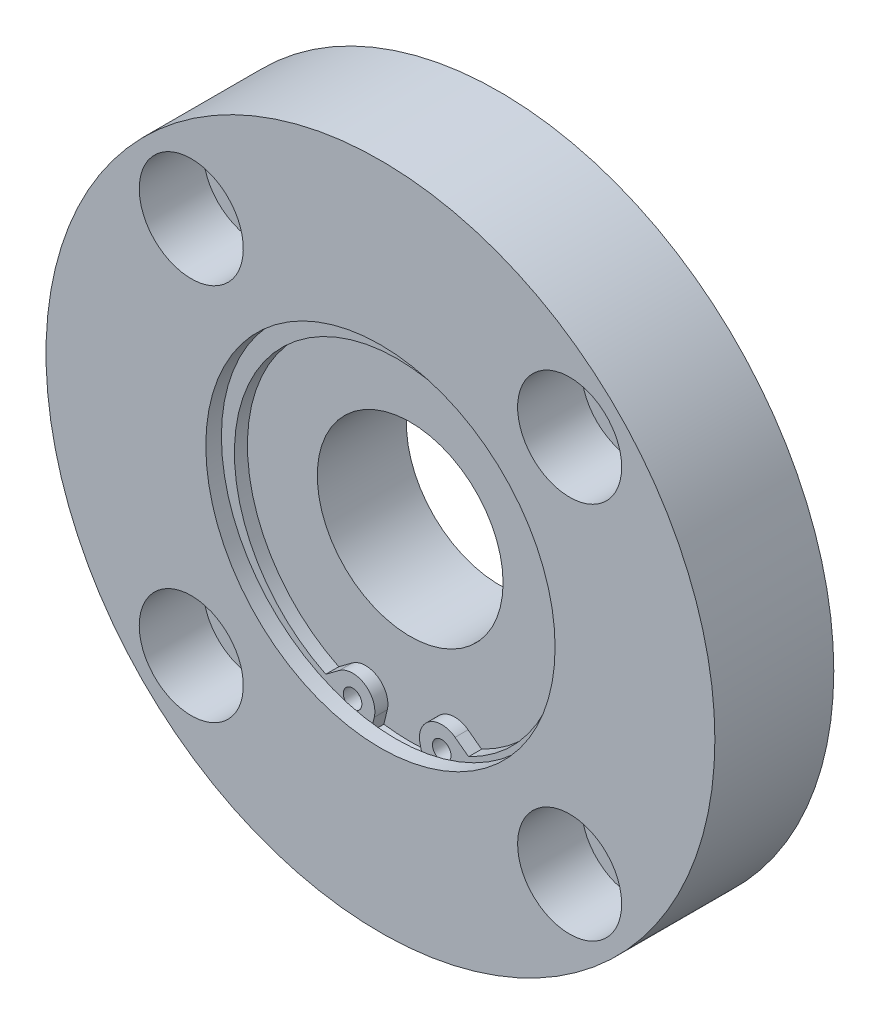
ISO-10303-21;
HEADER;
FILE_DESCRIPTION(('STEP AP214'),'2;1');
FILE_NAME('part.step','',(''),(''),'','','');
FILE_SCHEMA(('AUTOMOTIVE_DESIGN { 1 0 10303 214 1 1 1 1 }'));
ENDSEC;
DATA;
#1=APPLICATION_CONTEXT('core data for automotive mechanical design processes');
#2=APPLICATION_PROTOCOL_DEFINITION('international standard','automotive_design',2000,#1);
#3=PRODUCT_CONTEXT('',#1,'mechanical');
#4=PRODUCT('Part','Part','',(#3));
#5=PRODUCT_RELATED_PRODUCT_CATEGORY('part','',(#4));
#6=PRODUCT_DEFINITION_FORMATION('','',#4);
#7=PRODUCT_DEFINITION_CONTEXT('part definition',#1,'design');
#8=PRODUCT_DEFINITION('design','',#6,#7);
#9=PRODUCT_DEFINITION_SHAPE('','',#8);
#10=(LENGTH_UNIT() NAMED_UNIT(*) SI_UNIT(.MILLI.,.METRE.));
#11=(NAMED_UNIT(*) PLANE_ANGLE_UNIT() SI_UNIT($,.RADIAN.));
#12=(NAMED_UNIT(*) SI_UNIT($,.STERADIAN.) SOLID_ANGLE_UNIT());
#13=UNCERTAINTY_MEASURE_WITH_UNIT(LENGTH_MEASURE(1.E-05),#10,'distance_accuracy_value','');
#14=(GEOMETRIC_REPRESENTATION_CONTEXT(3) GLOBAL_UNCERTAINTY_ASSIGNED_CONTEXT((#13)) GLOBAL_UNIT_ASSIGNED_CONTEXT((#10,
#11,#12)) REPRESENTATION_CONTEXT('',''));
#15=CARTESIAN_POINT('',(0.,0.,0.));
#16=DIRECTION('',(0.,0.,1.));
#17=DIRECTION('',(1.,0.,0.));
#18=AXIS2_PLACEMENT_3D('',#15,#16,#17);
#19=CARTESIAN_POINT('',(25.4558441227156,25.4558441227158,0.));
#20=DIRECTION('',(0.,0.,1.));
#21=DIRECTION('',(1.,0.,0.));
#22=AXIS2_PLACEMENT_3D('',#19,#20,#21);
#23=CYLINDRICAL_SURFACE('',#22,5.);
#24=CARTESIAN_POINT('',(25.4558441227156,25.4558441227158,0.));
#25=DIRECTION('',(0.,0.,1.));
#26=DIRECTION('',(1.,0.,0.));
#27=AXIS2_PLACEMENT_3D('',#24,#25,#26);
#28=CIRCLE('',#27,5.);
#29=CARTESIAN_POINT('',(30.4558441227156,25.4558441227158,0.));
#30=VERTEX_POINT('',#29);
#31=EDGE_CURVE('E225',#30,#30,#28,.T.);
#32=ORIENTED_EDGE('',*,*,#31,.F.);
#33=EDGE_LOOP('',(#32));
#34=FACE_BOUND('',#33,.T.);
#35=CARTESIAN_POINT('',(25.4558441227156,25.4558441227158,7.4));
#36=DIRECTION('',(0.,0.,1.));
#37=DIRECTION('',(1.,0.,0.));
#38=AXIS2_PLACEMENT_3D('',#35,#36,#37);
#39=CIRCLE('',#38,5.);
#40=CARTESIAN_POINT('',(30.4558441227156,25.4558441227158,7.4));
#41=VERTEX_POINT('',#40);
#42=EDGE_CURVE('E224',#41,#41,#39,.F.);
#43=ORIENTED_EDGE('',*,*,#42,.F.);
#44=EDGE_LOOP('',(#43));
#45=FACE_BOUND('',#44,.T.);
#46=ADVANCED_FACE('F14',(#34,#45),#23,.F.);
#47=CARTESIAN_POINT('',(25.4558441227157,-25.4558441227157,0.));
#48=DIRECTION('',(0.,0.,1.));
#49=DIRECTION('',(1.,0.,0.));
#50=AXIS2_PLACEMENT_3D('',#47,#48,#49);
#51=CYLINDRICAL_SURFACE('',#50,5.);
#52=CARTESIAN_POINT('',(25.4558441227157,-25.4558441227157,0.));
#53=DIRECTION('',(0.,0.,1.));
#54=DIRECTION('',(0.,-1.,0.));
#55=AXIS2_PLACEMENT_3D('',#52,#53,#54);
#56=CIRCLE('',#55,5.);
#57=CARTESIAN_POINT('',(25.4558441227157,-30.4558441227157,0.));
#58=VERTEX_POINT('',#57);
#59=EDGE_CURVE('E215',#58,#58,#56,.T.);
#60=ORIENTED_EDGE('',*,*,#59,.F.);
#61=EDGE_LOOP('',(#60));
#62=FACE_BOUND('',#61,.T.);
#63=CARTESIAN_POINT('',(25.4558441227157,-25.4558441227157,7.4));
#64=DIRECTION('',(0.,0.,1.));
#65=DIRECTION('',(1.,0.,0.));
#66=AXIS2_PLACEMENT_3D('',#63,#64,#65);
#67=CIRCLE('',#66,5.);
#68=CARTESIAN_POINT('',(30.4558441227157,-25.4558441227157,7.4));
#69=VERTEX_POINT('',#68);
#70=EDGE_CURVE('E208',#69,#69,#67,.F.);
#71=ORIENTED_EDGE('',*,*,#70,.F.);
#72=EDGE_LOOP('',(#71));
#73=FACE_BOUND('',#72,.T.);
#74=ADVANCED_FACE('F339',(#62,#73),#51,.F.);
#75=CARTESIAN_POINT('',(-25.4558441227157,-25.4558441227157,0.));
#76=DIRECTION('',(0.,0.,1.));
#77=DIRECTION('',(1.,0.,0.));
#78=AXIS2_PLACEMENT_3D('',#75,#76,#77);
#79=CYLINDRICAL_SURFACE('',#78,5.);
#80=CARTESIAN_POINT('',(-25.4558441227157,-25.4558441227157,0.));
#81=DIRECTION('',(0.,0.,1.));
#82=DIRECTION('',(-1.,0.,0.));
#83=AXIS2_PLACEMENT_3D('',#80,#81,#82);
#84=CIRCLE('',#83,5.);
#85=CARTESIAN_POINT('',(-30.4558441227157,-25.4558441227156,0.));
#86=VERTEX_POINT('',#85);
#87=EDGE_CURVE('E212',#86,#86,#84,.T.);
#88=ORIENTED_EDGE('',*,*,#87,.F.);
#89=EDGE_LOOP('',(#88));
#90=FACE_BOUND('',#89,.T.);
#91=CARTESIAN_POINT('',(-25.4558441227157,-25.4558441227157,7.4));
#92=DIRECTION('',(0.,0.,1.));
#93=DIRECTION('',(1.,0.,0.));
#94=AXIS2_PLACEMENT_3D('',#91,#92,#93);
#95=CIRCLE('',#94,5.);
#96=CARTESIAN_POINT('',(-20.4558441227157,-25.4558441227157,7.4));
#97=VERTEX_POINT('',#96);
#98=EDGE_CURVE('E201',#97,#97,#95,.F.);
#99=ORIENTED_EDGE('',*,*,#98,.F.);
#100=EDGE_LOOP('',(#99));
#101=FACE_BOUND('',#100,.T.);
#102=ADVANCED_FACE('F352',(#90,#101),#79,.F.);
#103=CARTESIAN_POINT('',(-25.4558441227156,25.4558441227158,0.));
#104=DIRECTION('',(0.,0.,1.));
#105=DIRECTION('',(1.,0.,0.));
#106=AXIS2_PLACEMENT_3D('',#103,#104,#105);
#107=CYLINDRICAL_SURFACE('',#106,5.);
#108=CARTESIAN_POINT('',(-25.4558441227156,25.4558441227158,0.));
#109=DIRECTION('',(0.,0.,1.));
#110=DIRECTION('',(0.,1.,0.));
#111=AXIS2_PLACEMENT_3D('',#108,#109,#110);
#112=CIRCLE('',#111,5.);
#113=CARTESIAN_POINT('',(-25.4558441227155,30.4558441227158,0.));
#114=VERTEX_POINT('',#113);
#115=EDGE_CURVE('E209',#114,#114,#112,.T.);
#116=ORIENTED_EDGE('',*,*,#115,.F.);
#117=EDGE_LOOP('',(#116));
#118=FACE_BOUND('',#117,.T.);
#119=CARTESIAN_POINT('',(-25.4558441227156,25.4558441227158,7.4));
#120=DIRECTION('',(0.,0.,1.));
#121=DIRECTION('',(1.,0.,0.));
#122=AXIS2_PLACEMENT_3D('',#119,#120,#121);
#123=CIRCLE('',#122,5.);
#124=CARTESIAN_POINT('',(-20.4558441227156,25.4558441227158,7.4));
#125=VERTEX_POINT('',#124);
#126=EDGE_CURVE('E194',#125,#125,#123,.F.);
#127=ORIENTED_EDGE('',*,*,#126,.F.);
#128=EDGE_LOOP('',(#127));
#129=FACE_BOUND('',#128,.T.);
#130=ADVANCED_FACE('F356',(#118,#129),#107,.F.);
#131=CARTESIAN_POINT('',(0.,0.,-5.));
#132=DIRECTION('',(0.,0.,1.));
#133=DIRECTION('',(1.,0.,0.));
#134=AXIS2_PLACEMENT_3D('',#131,#132,#133);
#135=CYLINDRICAL_SURFACE('',#134,27.);
#136=CARTESIAN_POINT('',(0.,0.,-5.));
#137=DIRECTION('',(0.,0.,-1.));
#138=DIRECTION('',(-1.,0.,0.));
#139=AXIS2_PLACEMENT_3D('',#136,#137,#138);
#140=CIRCLE('',#139,27.);
#141=CARTESIAN_POINT('',(-27.,0.,-5.));
#142=VERTEX_POINT('',#141);
#143=EDGE_CURVE('E176',#142,#142,#140,.T.);
#144=ORIENTED_EDGE('',*,*,#143,.F.);
#145=EDGE_LOOP('',(#144));
#146=FACE_BOUND('',#145,.T.);
#147=CARTESIAN_POINT('',(0.,0.,0.));
#148=DIRECTION('',(0.,0.,-1.));
#149=DIRECTION('',(-1.,0.,0.));
#150=AXIS2_PLACEMENT_3D('',#147,#148,#149);
#151=CIRCLE('',#150,27.);
#152=CARTESIAN_POINT('',(-27.,0.,0.));
#153=VERTEX_POINT('',#152);
#154=EDGE_CURVE('E177',#153,#153,#151,.T.);
#155=ORIENTED_EDGE('',*,*,#154,.T.);
#156=EDGE_LOOP('',(#155));
#157=FACE_BOUND('',#156,.T.);
#158=ADVANCED_FACE('F360',(#146,#157),#135,.T.);
#159=CARTESIAN_POINT('',(0.,0.,0.));
#160=DIRECTION('',(0.,0.,1.));
#161=DIRECTION('',(1.,0.,0.));
#162=AXIS2_PLACEMENT_3D('',#159,#160,#161);
#163=PLANE('',#162);
#164=ORIENTED_EDGE('',*,*,#115,.T.);
#165=EDGE_LOOP('',(#164));
#166=FACE_BOUND('',#165,.T.);
#167=ORIENTED_EDGE('',*,*,#87,.T.);
#168=EDGE_LOOP('',(#167));
#169=FACE_BOUND('',#168,.T.);
#170=ORIENTED_EDGE('',*,*,#59,.T.);
#171=EDGE_LOOP('',(#170));
#172=FACE_BOUND('',#171,.T.);
#173=ORIENTED_EDGE('',*,*,#31,.T.);
#174=EDGE_LOOP('',(#173));
#175=FACE_BOUND('',#174,.T.);
#176=CARTESIAN_POINT('',(0.,0.,0.));
#177=DIRECTION('',(0.,0.,1.));
#178=DIRECTION('',(1.,0.,0.));
#179=AXIS2_PLACEMENT_3D('',#176,#177,#178);
#180=CIRCLE('',#179,45.);
#181=CARTESIAN_POINT('',(45.,0.,0.));
#182=VERTEX_POINT('',#181);
#183=EDGE_CURVE('E231',#182,#182,#180,.T.);
#184=ORIENTED_EDGE('',*,*,#183,.F.);
#185=EDGE_LOOP('',(#184));
#186=FACE_BOUND('',#185,.T.);
#187=ORIENTED_EDGE('',*,*,#154,.F.);
#188=EDGE_LOOP('',(#187));
#189=FACE_BOUND('',#188,.T.);
#190=ADVANCED_FACE('F332',(#166,#169,#172,#175,#186,#189),#163,.F.);
#191=CARTESIAN_POINT('',(25.4558441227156,25.4558441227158,7.4));
#192=DIRECTION('',(0.,0.,1.));
#193=DIRECTION('',(1.,0.,0.));
#194=AXIS2_PLACEMENT_3D('',#191,#192,#193);
#195=PLANE('',#194);
#196=CARTESIAN_POINT('',(25.4558441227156,25.4558441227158,7.4));
#197=DIRECTION('',(0.,0.,1.));
#198=DIRECTION('',(1.,0.,0.));
#199=AXIS2_PLACEMENT_3D('',#196,#197,#198);
#200=CIRCLE('',#199,7.);
#201=CARTESIAN_POINT('',(32.4558441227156,25.4558441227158,7.4));
#202=VERTEX_POINT('',#201);
#203=EDGE_CURVE('E221',#202,#202,#200,.T.);
#204=ORIENTED_EDGE('',*,*,#203,.T.);
#205=EDGE_LOOP('',(#204));
#206=FACE_BOUND('',#205,.T.);
#207=ORIENTED_EDGE('',*,*,#42,.T.);
#208=EDGE_LOOP('',(#207));
#209=FACE_BOUND('',#208,.T.);
#210=ADVANCED_FACE('F345',(#206,#209),#195,.T.);
#211=CARTESIAN_POINT('',(25.4558441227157,-25.4558441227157,7.4));
#212=DIRECTION('',(0.,0.,1.));
#213=DIRECTION('',(0.,-1.,0.));
#214=AXIS2_PLACEMENT_3D('',#211,#212,#213);
#215=PLANE('',#214);
#216=CARTESIAN_POINT('',(25.4558441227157,-25.4558441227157,7.4));
#217=DIRECTION('',(0.,0.,1.));
#218=DIRECTION('',(0.,-1.,0.));
#219=AXIS2_PLACEMENT_3D('',#216,#217,#218);
#220=CIRCLE('',#219,7.);
#221=CARTESIAN_POINT('',(25.4558441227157,-32.4558441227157,7.4));
#222=VERTEX_POINT('',#221);
#223=EDGE_CURVE('E205',#222,#222,#220,.T.);
#224=ORIENTED_EDGE('',*,*,#223,.T.);
#225=EDGE_LOOP('',(#224));
#226=FACE_BOUND('',#225,.T.);
#227=ORIENTED_EDGE('',*,*,#70,.T.);
#228=EDGE_LOOP('',(#227));
#229=FACE_BOUND('',#228,.T.);
#230=ADVANCED_FACE('F348',(#226,#229),#215,.T.);
#231=CARTESIAN_POINT('',(-25.4558441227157,-25.4558441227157,7.4));
#232=DIRECTION('',(0.,0.,1.));
#233=DIRECTION('',(-1.,0.,0.));
#234=AXIS2_PLACEMENT_3D('',#231,#232,#233);
#235=PLANE('',#234);
#236=CARTESIAN_POINT('',(-25.4558441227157,-25.4558441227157,7.4));
#237=DIRECTION('',(0.,0.,1.));
#238=DIRECTION('',(-1.,0.,0.));
#239=AXIS2_PLACEMENT_3D('',#236,#237,#238);
#240=CIRCLE('',#239,7.);
#241=CARTESIAN_POINT('',(-32.4558441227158,-25.4558441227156,7.4));
#242=VERTEX_POINT('',#241);
#243=EDGE_CURVE('E198',#242,#242,#240,.T.);
#244=ORIENTED_EDGE('',*,*,#243,.T.);
#245=EDGE_LOOP('',(#244));
#246=FACE_BOUND('',#245,.T.);
#247=ORIENTED_EDGE('',*,*,#98,.T.);
#248=EDGE_LOOP('',(#247));
#249=FACE_BOUND('',#248,.T.);
#250=ADVANCED_FACE('F368',(#246,#249),#235,.T.);
#251=CARTESIAN_POINT('',(-25.4558441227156,25.4558441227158,7.4));
#252=DIRECTION('',(0.,0.,1.));
#253=DIRECTION('',(0.,1.,0.));
#254=AXIS2_PLACEMENT_3D('',#251,#252,#253);
#255=PLANE('',#254);
#256=CARTESIAN_POINT('',(-25.4558441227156,25.4558441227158,7.4));
#257=DIRECTION('',(0.,0.,1.));
#258=DIRECTION('',(0.,1.,0.));
#259=AXIS2_PLACEMENT_3D('',#256,#257,#258);
#260=CIRCLE('',#259,7.);
#261=CARTESIAN_POINT('',(-25.4558441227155,32.4558441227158,7.4));
#262=VERTEX_POINT('',#261);
#263=EDGE_CURVE('E191',#262,#262,#260,.T.);
#264=ORIENTED_EDGE('',*,*,#263,.T.);
#265=EDGE_LOOP('',(#264));
#266=FACE_BOUND('',#265,.T.);
#267=ORIENTED_EDGE('',*,*,#126,.T.);
#268=EDGE_LOOP('',(#267));
#269=FACE_BOUND('',#268,.T.);
#270=ADVANCED_FACE('F376',(#266,#269),#255,.T.);
#271=CARTESIAN_POINT('',(0.,0.,-5.));
#272=DIRECTION('',(0.,0.,-1.));
#273=DIRECTION('',(-1.,0.,0.));
#274=AXIS2_PLACEMENT_3D('',#271,#272,#273);
#275=PLANE('',#274);
#276=ORIENTED_EDGE('',*,*,#143,.T.);
#277=EDGE_LOOP('',(#276));
#278=FACE_BOUND('',#277,.T.);
#279=CARTESIAN_POINT('',(0.,0.,-5.));
#280=DIRECTION('',(0.,0.,-1.));
#281=DIRECTION('',(-1.,0.,0.));
#282=AXIS2_PLACEMENT_3D('',#279,#280,#281);
#283=CIRCLE('',#282,20.5);
#284=CARTESIAN_POINT('',(-20.5,0.,-5.));
#285=VERTEX_POINT('',#284);
#286=EDGE_CURVE('E173',#285,#285,#283,.T.);
#287=ORIENTED_EDGE('',*,*,#286,.F.);
#288=EDGE_LOOP('',(#287));
#289=FACE_BOUND('',#288,.T.);
#290=ADVANCED_FACE('F320',(#278,#289),#275,.T.);
#291=CARTESIAN_POINT('',(0.,0.,16.));
#292=DIRECTION('',(0.,0.,-1.));
#293=DIRECTION('',(-1.,0.,0.));
#294=AXIS2_PLACEMENT_3D('',#291,#292,#293);
#295=CYLINDRICAL_SURFACE('',#294,45.);
#296=CARTESIAN_POINT('',(0.,0.,16.));
#297=DIRECTION('',(0.,0.,1.));
#298=DIRECTION('',(1.,0.,0.));
#299=AXIS2_PLACEMENT_3D('',#296,#297,#298);
#300=CIRCLE('',#299,45.);
#301=CARTESIAN_POINT('',(45.,0.,16.));
#302=VERTEX_POINT('',#301);
#303=EDGE_CURVE('E181',#302,#302,#300,.T.);
#304=ORIENTED_EDGE('',*,*,#303,.F.);
#305=EDGE_LOOP('',(#304));
#306=FACE_BOUND('',#305,.T.);
#307=ORIENTED_EDGE('',*,*,#183,.T.);
#308=EDGE_LOOP('',(#307));
#309=FACE_BOUND('',#308,.T.);
#310=ADVANCED_FACE('F316',(#306,#309),#295,.T.);
#311=CARTESIAN_POINT('',(25.4558441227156,25.4558441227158,7.4));
#312=DIRECTION('',(0.,0.,1.));
#313=DIRECTION('',(1.,0.,0.));
#314=AXIS2_PLACEMENT_3D('',#311,#312,#313);
#315=CYLINDRICAL_SURFACE('',#314,7.);
#316=ORIENTED_EDGE('',*,*,#203,.F.);
#317=EDGE_LOOP('',(#316));
#318=FACE_BOUND('',#317,.T.);
#319=CARTESIAN_POINT('',(25.4558441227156,25.4558441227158,16.));
#320=DIRECTION('',(0.,0.,1.));
#321=DIRECTION('',(1.,0.,0.));
#322=AXIS2_PLACEMENT_3D('',#319,#320,#321);
#323=CIRCLE('',#322,7.);
#324=CARTESIAN_POINT('',(32.4558441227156,25.4558441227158,16.));
#325=VERTEX_POINT('',#324);
#326=EDGE_CURVE('E218',#325,#325,#323,.T.);
#327=ORIENTED_EDGE('',*,*,#326,.T.);
#328=EDGE_LOOP('',(#327));
#329=FACE_BOUND('',#328,.T.);
#330=ADVANCED_FACE('F319',(#318,#329),#315,.F.);
#331=CARTESIAN_POINT('',(25.4558441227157,-25.4558441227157,7.4));
#332=DIRECTION('',(0.,0.,1.));
#333=DIRECTION('',(1.,0.,0.));
#334=AXIS2_PLACEMENT_3D('',#331,#332,#333);
#335=CYLINDRICAL_SURFACE('',#334,7.);
#336=ORIENTED_EDGE('',*,*,#223,.F.);
#337=EDGE_LOOP('',(#336));
#338=FACE_BOUND('',#337,.T.);
#339=CARTESIAN_POINT('',(25.4558441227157,-25.4558441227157,16.));
#340=DIRECTION('',(0.,0.,1.));
#341=DIRECTION('',(0.,-1.,0.));
#342=AXIS2_PLACEMENT_3D('',#339,#340,#341);
#343=CIRCLE('',#342,7.);
#344=CARTESIAN_POINT('',(25.4558441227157,-32.4558441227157,16.));
#345=VERTEX_POINT('',#344);
#346=EDGE_CURVE('E202',#345,#345,#343,.T.);
#347=ORIENTED_EDGE('',*,*,#346,.T.);
#348=EDGE_LOOP('',(#347));
#349=FACE_BOUND('',#348,.T.);
#350=ADVANCED_FACE('F343',(#338,#349),#335,.F.);
#351=CARTESIAN_POINT('',(-25.4558441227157,-25.4558441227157,7.4));
#352=DIRECTION('',(0.,0.,1.));
#353=DIRECTION('',(1.,0.,0.));
#354=AXIS2_PLACEMENT_3D('',#351,#352,#353);
#355=CYLINDRICAL_SURFACE('',#354,7.);
#356=ORIENTED_EDGE('',*,*,#243,.F.);
#357=EDGE_LOOP('',(#356));
#358=FACE_BOUND('',#357,.T.);
#359=CARTESIAN_POINT('',(-25.4558441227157,-25.4558441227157,16.));
#360=DIRECTION('',(0.,0.,1.));
#361=DIRECTION('',(-1.,0.,0.));
#362=AXIS2_PLACEMENT_3D('',#359,#360,#361);
#363=CIRCLE('',#362,7.);
#364=CARTESIAN_POINT('',(-32.4558441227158,-25.4558441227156,16.));
#365=VERTEX_POINT('',#364);
#366=EDGE_CURVE('E195',#365,#365,#363,.T.);
#367=ORIENTED_EDGE('',*,*,#366,.T.);
#368=EDGE_LOOP('',(#367));
#369=FACE_BOUND('',#368,.T.);
#370=ADVANCED_FACE('F364',(#358,#369),#355,.F.);
#371=CARTESIAN_POINT('',(-25.4558441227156,25.4558441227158,7.4));
#372=DIRECTION('',(0.,0.,1.));
#373=DIRECTION('',(1.,0.,0.));
#374=AXIS2_PLACEMENT_3D('',#371,#372,#373);
#375=CYLINDRICAL_SURFACE('',#374,7.);
#376=ORIENTED_EDGE('',*,*,#263,.F.);
#377=EDGE_LOOP('',(#376));
#378=FACE_BOUND('',#377,.T.);
#379=CARTESIAN_POINT('',(-25.4558441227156,25.4558441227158,16.));
#380=DIRECTION('',(0.,0.,1.));
#381=DIRECTION('',(0.,1.,0.));
#382=AXIS2_PLACEMENT_3D('',#379,#380,#381);
#383=CIRCLE('',#382,7.);
#384=CARTESIAN_POINT('',(-25.4558441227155,32.4558441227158,16.));
#385=VERTEX_POINT('',#384);
#386=EDGE_CURVE('E188',#385,#385,#383,.T.);
#387=ORIENTED_EDGE('',*,*,#386,.T.);
#388=EDGE_LOOP('',(#387));
#389=FACE_BOUND('',#388,.T.);
#390=ADVANCED_FACE('F372',(#378,#389),#375,.F.);
#391=CARTESIAN_POINT('',(0.,0.,-5.));
#392=DIRECTION('',(0.,0.,1.));
#393=DIRECTION('',(1.,0.,0.));
#394=AXIS2_PLACEMENT_3D('',#391,#392,#393);
#395=CYLINDRICAL_SURFACE('',#394,20.5);
#396=ORIENTED_EDGE('',*,*,#286,.T.);
#397=EDGE_LOOP('',(#396));
#398=FACE_BOUND('',#397,.T.);
#399=CARTESIAN_POINT('',(0.,0.,0.));
#400=DIRECTION('',(0.,0.,-1.));
#401=DIRECTION('',(-1.,0.,0.));
#402=AXIS2_PLACEMENT_3D('',#399,#400,#401);
#403=CIRCLE('',#402,20.5);
#404=CARTESIAN_POINT('',(-20.5,0.,0.));
#405=VERTEX_POINT('',#404);
#406=EDGE_CURVE('E170',#405,#405,#403,.T.);
#407=ORIENTED_EDGE('',*,*,#406,.F.);
#408=EDGE_LOOP('',(#407));
#409=FACE_BOUND('',#408,.T.);
#410=ADVANCED_FACE('F326',(#398,#409),#395,.F.);
#411=CARTESIAN_POINT('',(0.,0.,16.));
#412=DIRECTION('',(0.,0.,1.));
#413=DIRECTION('',(1.,0.,0.));
#414=AXIS2_PLACEMENT_3D('',#411,#412,#413);
#415=PLANE('',#414);
#416=CARTESIAN_POINT('',(0.,0.,16.));
#417=DIRECTION('',(0.,0.,1.));
#418=DIRECTION('',(1.,0.,0.));
#419=AXIS2_PLACEMENT_3D('',#416,#417,#418);
#420=CIRCLE('',#419,23.5);
#421=CARTESIAN_POINT('',(23.5,0.,16.));
#422=VERTEX_POINT('',#421);
#423=EDGE_CURVE('E184',#422,#422,#420,.T.);
#424=ORIENTED_EDGE('',*,*,#423,.F.);
#425=EDGE_LOOP('',(#424));
#426=FACE_BOUND('',#425,.T.);
#427=ORIENTED_EDGE('',*,*,#386,.F.);
#428=EDGE_LOOP('',(#427));
#429=FACE_BOUND('',#428,.T.);
#430=ORIENTED_EDGE('',*,*,#366,.F.);
#431=EDGE_LOOP('',(#430));
#432=FACE_BOUND('',#431,.T.);
#433=ORIENTED_EDGE('',*,*,#346,.F.);
#434=EDGE_LOOP('',(#433));
#435=FACE_BOUND('',#434,.T.);
#436=ORIENTED_EDGE('',*,*,#326,.F.);
#437=EDGE_LOOP('',(#436));
#438=FACE_BOUND('',#437,.T.);
#439=ORIENTED_EDGE('',*,*,#303,.T.);
#440=EDGE_LOOP('',(#439));
#441=FACE_BOUND('',#440,.T.);
#442=ADVANCED_FACE('F322',(#426,#429,#432,#435,#438,#441),#415,.T.);
#443=ORIENTED_EDGE('',*,*,#406,.T.);
#444=EDGE_LOOP('',(#443));
#445=FACE_BOUND('',#444,.T.);
#446=CARTESIAN_POINT('',(0.,0.,0.));
#447=DIRECTION('',(0.,0.,1.));
#448=DIRECTION('',(1.,0.,0.));
#449=AXIS2_PLACEMENT_3D('',#446,#447,#448);
#450=CIRCLE('',#449,12.5);
#451=CARTESIAN_POINT('',(12.5,0.,0.));
#452=VERTEX_POINT('',#451);
#453=EDGE_CURVE('E228',#452,#452,#450,.T.);
#454=ORIENTED_EDGE('',*,*,#453,.T.);
#455=EDGE_LOOP('',(#454));
#456=FACE_BOUND('',#455,.T.);
#457=ADVANCED_FACE('F325',(#445,#456),#163,.F.);
#458=CARTESIAN_POINT('',(0.,0.,12.));
#459=DIRECTION('',(0.,0.,1.));
#460=DIRECTION('',(1.,0.,0.));
#461=AXIS2_PLACEMENT_3D('',#458,#459,#460);
#462=CYLINDRICAL_SURFACE('',#461,23.5);
#463=CARTESIAN_POINT('',(0.,0.,13.9));
#464=DIRECTION('',(0.,0.,1.));
#465=DIRECTION('',(1.,0.,0.));
#466=AXIS2_PLACEMENT_3D('',#463,#464,#465);
#467=CIRCLE('',#466,23.5);
#468=CARTESIAN_POINT('',(23.5,0.,13.9));
#469=VERTEX_POINT('',#468);
#470=EDGE_CURVE('E167',#469,#469,#467,.F.);
#471=ORIENTED_EDGE('',*,*,#470,.T.);
#472=EDGE_LOOP('',(#471));
#473=FACE_BOUND('',#472,.T.);
#474=ORIENTED_EDGE('',*,*,#423,.T.);
#475=EDGE_LOOP('',(#474));
#476=FACE_BOUND('',#475,.T.);
#477=ADVANCED_FACE('F330',(#473,#476),#462,.F.);
#478=CARTESIAN_POINT('',(0.,0.,16.));
#479=DIRECTION('',(0.,0.,-1.));
#480=DIRECTION('',(-1.,0.,0.));
#481=AXIS2_PLACEMENT_3D('',#478,#479,#480);
#482=CYLINDRICAL_SURFACE('',#481,12.5);
#483=ORIENTED_EDGE('',*,*,#453,.F.);
#484=EDGE_LOOP('',(#483));
#485=FACE_BOUND('',#484,.T.);
#486=CARTESIAN_POINT('',(0.,0.,12.));
#487=DIRECTION('',(0.,0.,1.));
#488=DIRECTION('',(1.,0.,0.));
#489=AXIS2_PLACEMENT_3D('',#486,#487,#488);
#490=CIRCLE('',#489,12.5);
#491=CARTESIAN_POINT('',(12.5,0.,12.));
#492=VERTEX_POINT('',#491);
#493=EDGE_CURVE('E187',#492,#492,#490,.T.);
#494=ORIENTED_EDGE('',*,*,#493,.T.);
#495=EDGE_LOOP('',(#494));
#496=FACE_BOUND('',#495,.T.);
#497=ADVANCED_FACE('F333',(#485,#496),#482,.F.);
#498=CARTESIAN_POINT('',(0.,0.,12.));
#499=DIRECTION('',(0.,0.,1.));
#500=DIRECTION('',(1.,0.,0.));
#501=AXIS2_PLACEMENT_3D('',#498,#499,#500);
#502=PLANE('',#501);
#503=ORIENTED_EDGE('',*,*,#493,.F.);
#504=EDGE_LOOP('',(#503));
#505=FACE_BOUND('',#504,.T.);
#506=CARTESIAN_POINT('',(0.,0.,12.));
#507=DIRECTION('',(0.,0.,1.));
#508=DIRECTION('',(1.,0.,0.));
#509=AXIS2_PLACEMENT_3D('',#506,#507,#508);
#510=CIRCLE('',#509,24.75);
#511=CARTESIAN_POINT('',(-3.53738888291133,-24.4959053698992,12.));
#512=VERTEX_POINT('',#511);
#513=CARTESIAN_POINT('',(3.53738888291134,-24.4959053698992,12.));
#514=VERTEX_POINT('',#513);
#515=EDGE_CURVE('E157',#512,#514,#510,.T.);
#516=ORIENTED_EDGE('',*,*,#515,.T.);
#517=DIRECTION('',(-0.231349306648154,0.972870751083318,0.));
#518=VECTOR('',#517,1.);
#519=CARTESIAN_POINT('',(-2.16530728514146,-0.514911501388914,12.));
#520=LINE('',#519,#518);
#521=CARTESIAN_POINT('',(3.08138774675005,-22.5783281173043,12.));
#522=VERTEX_POINT('',#521);
#523=EDGE_CURVE('E9',#514,#522,#520,.T.);
#524=ORIENTED_EDGE('',*,*,#523,.T.);
#525=CARTESIAN_POINT('',(6.,-21.8842801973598,12.));
#526=DIRECTION('',(0.,0.,1.));
#527=DIRECTION('',(1.,0.,0.));
#528=AXIS2_PLACEMENT_3D('',#525,#526,#527);
#529=CIRCLE('',#528,3.);
#530=CARTESIAN_POINT('',(7.7896612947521,-19.4765608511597,12.));
#531=VERTEX_POINT('',#530);
#532=EDGE_CURVE('E25',#531,#522,#529,.T.);
#533=ORIENTED_EDGE('',*,*,#532,.F.);
#534=DIRECTION('',(0.802573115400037,-0.596553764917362,0.));
#535=VECTOR('',#534,1.);
#536=CARTESIAN_POINT('',(-6.55279254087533,-8.81579403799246,12.));
#537=LINE('',#536,#535);
#538=CARTESIAN_POINT('',(9.60938951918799,-20.8291674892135,12.));
#539=VERTEX_POINT('',#538);
#540=EDGE_CURVE('E101',#531,#539,#537,.T.);
#541=ORIENTED_EDGE('',*,*,#540,.T.);
#542=CARTESIAN_POINT('',(0.,-1.15,12.));
#543=DIRECTION('',(0.,0.,1.));
#544=DIRECTION('',(1.,0.,0.));
#545=AXIS2_PLACEMENT_3D('',#542,#543,#544);
#546=CIRCLE('',#545,21.9);
#547=CARTESIAN_POINT('',(-9.60938951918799,-20.8291674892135,12.));
#548=VERTEX_POINT('',#547);
#549=EDGE_CURVE('E104',#539,#548,#546,.T.);
#550=ORIENTED_EDGE('',*,*,#549,.T.);
#551=DIRECTION('',(0.802573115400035,0.596553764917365,0.));
#552=VECTOR('',#551,1.);
#553=CARTESIAN_POINT('',(6.55279254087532,-8.81579403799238,12.));
#554=LINE('',#553,#552);
#555=CARTESIAN_POINT('',(-7.7896612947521,-19.4765608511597,12.));
#556=VERTEX_POINT('',#555);
#557=EDGE_CURVE('E119',#548,#556,#554,.T.);
#558=ORIENTED_EDGE('',*,*,#557,.T.);
#559=CARTESIAN_POINT('',(-6.,-21.8842801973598,12.));
#560=DIRECTION('',(0.,0.,1.));
#561=DIRECTION('',(1.,0.,0.));
#562=AXIS2_PLACEMENT_3D('',#559,#560,#561);
#563=CIRCLE('',#562,3.);
#564=CARTESIAN_POINT('',(-3.08138774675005,-22.5783281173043,12.));
#565=VERTEX_POINT('',#564);
#566=EDGE_CURVE('E261',#565,#556,#563,.T.);
#567=ORIENTED_EDGE('',*,*,#566,.F.);
#568=DIRECTION('',(-0.231349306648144,-0.97287075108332,0.));
#569=VECTOR('',#568,1.);
#570=CARTESIAN_POINT('',(2.16530728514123,-0.514911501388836,12.));
#571=LINE('',#570,#569);
#572=EDGE_CURVE('E74',#565,#512,#571,.T.);
#573=ORIENTED_EDGE('',*,*,#572,.T.);
#574=EDGE_LOOP('',(#516,#524,#533,#541,#550,#558,#567,#573));
#575=FACE_BOUND('',#574,.T.);
#576=ADVANCED_FACE('F103',(#505,#575),#502,.T.);
#577=CARTESIAN_POINT('',(0.,0.,13.9));
#578=DIRECTION('',(0.,0.,1.));
#579=DIRECTION('',(1.,0.,0.));
#580=AXIS2_PLACEMENT_3D('',#577,#578,#579);
#581=PLANE('',#580);
#582=CARTESIAN_POINT('',(0.,0.,13.9));
#583=DIRECTION('',(0.,0.,1.));
#584=DIRECTION('',(1.,0.,0.));
#585=AXIS2_PLACEMENT_3D('',#582,#583,#584);
#586=CIRCLE('',#585,24.75);
#587=CARTESIAN_POINT('',(24.75,0.,13.9));
#588=VERTEX_POINT('',#587);
#589=EDGE_CURVE('E163',#588,#588,#586,.T.);
#590=ORIENTED_EDGE('',*,*,#589,.F.);
#591=EDGE_LOOP('',(#590));
#592=FACE_BOUND('',#591,.T.);
#593=ORIENTED_EDGE('',*,*,#470,.F.);
#594=EDGE_LOOP('',(#593));
#595=FACE_BOUND('',#594,.T.);
#596=ADVANCED_FACE('F388',(#592,#595),#581,.F.);
#597=CARTESIAN_POINT('',(0.,0.,13.9));
#598=DIRECTION('',(0.,0.,-1.));
#599=DIRECTION('',(-1.,0.,0.));
#600=AXIS2_PLACEMENT_3D('',#597,#598,#599);
#601=CYLINDRICAL_SURFACE('',#600,24.75);
#602=ORIENTED_EDGE('',*,*,#589,.T.);
#603=EDGE_LOOP('',(#602));
#604=FACE_BOUND('',#603,.T.);
#605=CARTESIAN_POINT('',(0.,0.,13.75));
#606=DIRECTION('',(0.,0.,1.));
#607=DIRECTION('',(1.,0.,0.));
#608=AXIS2_PLACEMENT_3D('',#605,#606,#607);
#609=CIRCLE('',#608,24.75);
#610=CARTESIAN_POINT('',(3.53738888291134,-24.4959053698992,13.75));
#611=VERTEX_POINT('',#610);
#612=CARTESIAN_POINT('',(-3.53738888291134,-24.4959053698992,13.75));
#613=VERTEX_POINT('',#612);
#614=EDGE_CURVE('E180',#611,#613,#609,.T.);
#615=ORIENTED_EDGE('',*,*,#614,.F.);
#616=DIRECTION('',(0.,0.,-1.));
#617=VECTOR('',#616,1.);
#618=CARTESIAN_POINT('',(3.53738888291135,-24.4959053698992,13.9));
#619=LINE('',#618,#617);
#620=EDGE_CURVE('E251',#611,#514,#619,.T.);
#621=ORIENTED_EDGE('',*,*,#620,.T.);
#622=ORIENTED_EDGE('',*,*,#515,.F.);
#623=DIRECTION('',(0.,0.,-1.));
#624=VECTOR('',#623,1.);
#625=CARTESIAN_POINT('',(-3.53738888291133,-24.4959053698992,13.9));
#626=LINE('',#625,#624);
#627=EDGE_CURVE('E249',#512,#613,#626,.F.);
#628=ORIENTED_EDGE('',*,*,#627,.T.);
#629=EDGE_LOOP('',(#615,#621,#622,#628));
#630=FACE_BOUND('',#629,.T.);
#631=ADVANCED_FACE('F399',(#604,#630),#601,.F.);
#632=CARTESIAN_POINT('',(6.,-21.8842801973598,12.));
#633=DIRECTION('',(0.,0.,1.));
#634=DIRECTION('',(1.,0.,0.));
#635=AXIS2_PLACEMENT_3D('',#632,#633,#634);
#636=CIRCLE('',#635,1.25);
#637=CARTESIAN_POINT('',(7.25,-21.8842801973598,12.));
#638=VERTEX_POINT('',#637);
#639=EDGE_CURVE('E254',#638,#638,#636,.T.);
#640=ORIENTED_EDGE('',*,*,#639,.T.);
#641=EDGE_LOOP('',(#640));
#642=FACE_BOUND('',#641,.T.);
#643=ADVANCED_FACE('F287',(#642),#502,.T.);
#644=CARTESIAN_POINT('',(-6.,-21.8842801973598,12.));
#645=DIRECTION('',(0.,0.,1.));
#646=DIRECTION('',(1.,0.,0.));
#647=AXIS2_PLACEMENT_3D('',#644,#645,#646);
#648=CIRCLE('',#647,1.25);
#649=CARTESIAN_POINT('',(-4.75,-21.8842801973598,12.));
#650=VERTEX_POINT('',#649);
#651=EDGE_CURVE('E257',#650,#650,#648,.T.);
#652=ORIENTED_EDGE('',*,*,#651,.T.);
#653=EDGE_LOOP('',(#652));
#654=FACE_BOUND('',#653,.T.);
#655=ADVANCED_FACE('F281',(#654),#502,.T.);
#656=CARTESIAN_POINT('',(6.,-21.8842801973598,13.8));
#657=DIRECTION('',(0.,0.,1.));
#658=DIRECTION('',(-1.,0.,0.));
#659=AXIS2_PLACEMENT_3D('',#656,#657,#658);
#660=CYLINDRICAL_SURFACE('',#659,3.);
#661=DIRECTION('',(0.,0.,-1.));
#662=VECTOR('',#661,1.);
#663=CARTESIAN_POINT('',(3.08138774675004,-22.5783281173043,13.8));
#664=LINE('',#663,#662);
#665=CARTESIAN_POINT('',(3.08138774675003,-22.5783281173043,13.75));
#666=VERTEX_POINT('',#665);
#667=EDGE_CURVE('E131',#666,#522,#664,.T.);
#668=ORIENTED_EDGE('',*,*,#667,.F.);
#669=CARTESIAN_POINT('',(6.,-21.8842801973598,13.75));
#670=DIRECTION('',(0.,0.,1.));
#671=DIRECTION('',(1.,0.,0.));
#672=AXIS2_PLACEMENT_3D('',#669,#670,#671);
#673=CIRCLE('',#672,3.);
#674=CARTESIAN_POINT('',(7.7896612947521,-19.4765608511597,13.75));
#675=VERTEX_POINT('',#674);
#676=EDGE_CURVE('E59',#675,#666,#673,.T.);
#677=ORIENTED_EDGE('',*,*,#676,.F.);
#678=DIRECTION('',(0.,0.,-1.));
#679=VECTOR('',#678,1.);
#680=CARTESIAN_POINT('',(7.7896612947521,-19.4765608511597,13.8));
#681=LINE('',#680,#679);
#682=EDGE_CURVE('E124',#675,#531,#681,.T.);
#683=ORIENTED_EDGE('',*,*,#682,.T.);
#684=ORIENTED_EDGE('',*,*,#532,.T.);
#685=EDGE_LOOP('',(#668,#677,#683,#684));
#686=FACE_BOUND('',#685,.T.);
#687=ADVANCED_FACE('F279',(#686),#660,.T.);
#688=CARTESIAN_POINT('',(7.7896612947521,-19.4765608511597,13.8));
#689=DIRECTION('',(-0.596553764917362,-0.802573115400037,0.));
#690=DIRECTION('',(-0.802573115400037,0.596553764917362,0.));
#691=AXIS2_PLACEMENT_3D('',#688,#689,#690);
#692=PLANE('',#691);
#693=DIRECTION('',(-0.802573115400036,0.596553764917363,0.));
#694=VECTOR('',#693,1.);
#695=CARTESIAN_POINT('',(9.60938951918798,-20.8291674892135,13.75));
#696=LINE('',#695,#694);
#697=CARTESIAN_POINT('',(9.60938951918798,-20.8291674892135,13.75));
#698=VERTEX_POINT('',#697);
#699=EDGE_CURVE('E122',#698,#675,#696,.T.);
#700=ORIENTED_EDGE('',*,*,#699,.F.);
#701=DIRECTION('',(0.,0.,-1.));
#702=VECTOR('',#701,1.);
#703=CARTESIAN_POINT('',(9.60938951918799,-20.8291674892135,13.8));
#704=LINE('',#703,#702);
#705=EDGE_CURVE('E115',#698,#539,#704,.T.);
#706=ORIENTED_EDGE('',*,*,#705,.T.);
#707=ORIENTED_EDGE('',*,*,#540,.F.);
#708=ORIENTED_EDGE('',*,*,#682,.F.);
#709=EDGE_LOOP('',(#700,#706,#707,#708));
#710=FACE_BOUND('',#709,.T.);
#711=ADVANCED_FACE('F16',(#710),#692,.F.);
#712=CARTESIAN_POINT('',(0.,-1.15,13.8));
#713=DIRECTION('',(0.,0.,1.));
#714=DIRECTION('',(-1.,0.,0.));
#715=AXIS2_PLACEMENT_3D('',#712,#713,#714);
#716=CYLINDRICAL_SURFACE('',#715,21.9);
#717=CARTESIAN_POINT('',(0.,-1.15,13.75));
#718=DIRECTION('',(0.,0.,-1.));
#719=DIRECTION('',(1.,0.,0.));
#720=AXIS2_PLACEMENT_3D('',#717,#718,#719);
#721=CIRCLE('',#720,21.9);
#722=CARTESIAN_POINT('',(-9.60938951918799,-20.8291674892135,13.75));
#723=VERTEX_POINT('',#722);
#724=EDGE_CURVE('E272',#723,#698,#721,.T.);
#725=ORIENTED_EDGE('',*,*,#724,.F.);
#726=DIRECTION('',(0.,0.,-1.));
#727=VECTOR('',#726,1.);
#728=CARTESIAN_POINT('',(-9.60938951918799,-20.8291674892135,13.8));
#729=LINE('',#728,#727);
#730=EDGE_CURVE('E117',#723,#548,#729,.T.);
#731=ORIENTED_EDGE('',*,*,#730,.T.);
#732=ORIENTED_EDGE('',*,*,#549,.F.);
#733=ORIENTED_EDGE('',*,*,#705,.F.);
#734=EDGE_LOOP('',(#725,#731,#732,#733));
#735=FACE_BOUND('',#734,.T.);
#736=ADVANCED_FACE('F114',(#735),#716,.F.);
#737=CARTESIAN_POINT('',(-7.7896612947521,-19.4765608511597,13.8));
#738=DIRECTION('',(0.596553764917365,-0.802573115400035,0.));
#739=DIRECTION('',(0.,0.,-1.));
#740=AXIS2_PLACEMENT_3D('',#737,#738,#739);
#741=PLANE('',#740);
#742=DIRECTION('',(-0.802573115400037,-0.596553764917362,0.));
#743=VECTOR('',#742,1.);
#744=CARTESIAN_POINT('',(-7.7896612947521,-19.4765608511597,13.75));
#745=LINE('',#744,#743);
#746=CARTESIAN_POINT('',(-7.7896612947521,-19.4765608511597,13.75));
#747=VERTEX_POINT('',#746);
#748=EDGE_CURVE('E270',#747,#723,#745,.T.);
#749=ORIENTED_EDGE('',*,*,#748,.F.);
#750=DIRECTION('',(0.,0.,-1.));
#751=VECTOR('',#750,1.);
#752=CARTESIAN_POINT('',(-7.7896612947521,-19.4765608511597,13.8));
#753=LINE('',#752,#751);
#754=EDGE_CURVE('E129',#747,#556,#753,.T.);
#755=ORIENTED_EDGE('',*,*,#754,.T.);
#756=ORIENTED_EDGE('',*,*,#557,.F.);
#757=ORIENTED_EDGE('',*,*,#730,.F.);
#758=EDGE_LOOP('',(#749,#755,#756,#757));
#759=FACE_BOUND('',#758,.T.);
#760=ADVANCED_FACE('F291',(#759),#741,.F.);
#761=CARTESIAN_POINT('',(-6.,-21.8842801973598,13.8));
#762=DIRECTION('',(0.,0.,1.));
#763=DIRECTION('',(-1.,0.,0.));
#764=AXIS2_PLACEMENT_3D('',#761,#762,#763);
#765=CYLINDRICAL_SURFACE('',#764,3.);
#766=ORIENTED_EDGE('',*,*,#754,.F.);
#767=CARTESIAN_POINT('',(-6.,-21.8842801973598,13.75));
#768=DIRECTION('',(0.,0.,1.));
#769=DIRECTION('',(1.,0.,0.));
#770=AXIS2_PLACEMENT_3D('',#767,#768,#769);
#771=CIRCLE('',#770,3.);
#772=CARTESIAN_POINT('',(-3.08138774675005,-22.5783281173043,13.75));
#773=VERTEX_POINT('',#772);
#774=EDGE_CURVE('E268',#773,#747,#771,.T.);
#775=ORIENTED_EDGE('',*,*,#774,.F.);
#776=DIRECTION('',(0.,0.,-1.));
#777=VECTOR('',#776,1.);
#778=CARTESIAN_POINT('',(-3.08138774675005,-22.5783281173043,13.8));
#779=LINE('',#778,#777);
#780=EDGE_CURVE('E134',#773,#565,#779,.T.);
#781=ORIENTED_EDGE('',*,*,#780,.T.);
#782=ORIENTED_EDGE('',*,*,#566,.T.);
#783=EDGE_LOOP('',(#766,#775,#781,#782));
#784=FACE_BOUND('',#783,.T.);
#785=ADVANCED_FACE('F294',(#784),#765,.T.);
#786=CARTESIAN_POINT('',(-3.08138774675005,-22.5783281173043,13.8));
#787=DIRECTION('',(-0.97287075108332,0.231349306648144,0.));
#788=DIRECTION('',(0.,0.,1.));
#789=AXIS2_PLACEMENT_3D('',#786,#787,#788);
#790=PLANE('',#789);
#791=ORIENTED_EDGE('',*,*,#627,.F.);
#792=ORIENTED_EDGE('',*,*,#572,.F.);
#793=ORIENTED_EDGE('',*,*,#780,.F.);
#794=DIRECTION('',(0.231349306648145,0.97287075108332,0.));
#795=VECTOR('',#794,1.);
#796=CARTESIAN_POINT('',(-3.65352473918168,-24.9842801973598,13.75));
#797=LINE('',#796,#795);
#798=EDGE_CURVE('E65',#613,#773,#797,.T.);
#799=ORIENTED_EDGE('',*,*,#798,.F.);
#800=EDGE_LOOP('',(#791,#792,#793,#799));
#801=FACE_BOUND('',#800,.T.);
#802=ADVANCED_FACE('F300',(#801),#790,.F.);
#803=CARTESIAN_POINT('',(3.08138774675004,-22.5783281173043,13.8));
#804=DIRECTION('',(0.972870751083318,0.231349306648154,0.));
#805=DIRECTION('',(0.,0.,-1.));
#806=AXIS2_PLACEMENT_3D('',#803,#804,#805);
#807=PLANE('',#806);
#808=ORIENTED_EDGE('',*,*,#620,.F.);
#809=DIRECTION('',(0.231349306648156,-0.972870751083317,0.));
#810=VECTOR('',#809,1.);
#811=CARTESIAN_POINT('',(3.08138774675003,-22.5783281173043,13.75));
#812=LINE('',#811,#810);
#813=EDGE_CURVE('E275',#666,#611,#812,.T.);
#814=ORIENTED_EDGE('',*,*,#813,.F.);
#815=ORIENTED_EDGE('',*,*,#667,.T.);
#816=ORIENTED_EDGE('',*,*,#523,.F.);
#817=EDGE_LOOP('',(#808,#814,#815,#816));
#818=FACE_BOUND('',#817,.T.);
#819=ADVANCED_FACE('F278',(#818),#807,.F.);
#820=CARTESIAN_POINT('',(-6.,-21.8842801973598,13.8));
#821=DIRECTION('',(0.,0.,1.));
#822=DIRECTION('',(-1.,0.,0.));
#823=AXIS2_PLACEMENT_3D('',#820,#821,#822);
#824=CYLINDRICAL_SURFACE('',#823,1.25);
#825=ORIENTED_EDGE('',*,*,#651,.F.);
#826=EDGE_LOOP('',(#825));
#827=FACE_BOUND('',#826,.T.);
#828=CARTESIAN_POINT('',(-6.,-21.8842801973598,13.75));
#829=DIRECTION('',(0.,0.,1.));
#830=DIRECTION('',(1.,0.,0.));
#831=AXIS2_PLACEMENT_3D('',#828,#829,#830);
#832=CIRCLE('',#831,1.25);
#833=CARTESIAN_POINT('',(-4.75,-21.8842801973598,13.75));
#834=VERTEX_POINT('',#833);
#835=EDGE_CURVE('E142',#834,#834,#832,.F.);
#836=ORIENTED_EDGE('',*,*,#835,.F.);
#837=EDGE_LOOP('',(#836));
#838=FACE_BOUND('',#837,.T.);
#839=ADVANCED_FACE('F298',(#827,#838),#824,.F.);
#840=CARTESIAN_POINT('',(6.,-21.8842801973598,13.8));
#841=DIRECTION('',(0.,0.,1.));
#842=DIRECTION('',(-1.,0.,0.));
#843=AXIS2_PLACEMENT_3D('',#840,#841,#842);
#844=CYLINDRICAL_SURFACE('',#843,1.25);
#845=ORIENTED_EDGE('',*,*,#639,.F.);
#846=EDGE_LOOP('',(#845));
#847=FACE_BOUND('',#846,.T.);
#848=CARTESIAN_POINT('',(6.,-21.8842801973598,13.75));
#849=DIRECTION('',(0.,0.,1.));
#850=DIRECTION('',(1.,0.,0.));
#851=AXIS2_PLACEMENT_3D('',#848,#849,#850);
#852=CIRCLE('',#851,1.25);
#853=CARTESIAN_POINT('',(7.25,-21.8842801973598,13.75));
#854=VERTEX_POINT('',#853);
#855=EDGE_CURVE('E18',#854,#854,#852,.F.);
#856=ORIENTED_EDGE('',*,*,#855,.F.);
#857=EDGE_LOOP('',(#856));
#858=FACE_BOUND('',#857,.T.);
#859=ADVANCED_FACE('F295',(#847,#858),#844,.F.);
#860=CARTESIAN_POINT('',(-6.,-21.8842801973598,13.75));
#861=DIRECTION('',(0.,0.,1.));
#862=DIRECTION('',(1.,0.,0.));
#863=AXIS2_PLACEMENT_3D('',#860,#861,#862);
#864=PLANE('',#863);
#865=ORIENTED_EDGE('',*,*,#855,.T.);
#866=EDGE_LOOP('',(#865));
#867=FACE_BOUND('',#866,.T.);
#868=ORIENTED_EDGE('',*,*,#835,.T.);
#869=EDGE_LOOP('',(#868));
#870=FACE_BOUND('',#869,.T.);
#871=ORIENTED_EDGE('',*,*,#813,.T.);
#872=ORIENTED_EDGE('',*,*,#614,.T.);
#873=ORIENTED_EDGE('',*,*,#798,.T.);
#874=ORIENTED_EDGE('',*,*,#774,.T.);
#875=ORIENTED_EDGE('',*,*,#748,.T.);
#876=ORIENTED_EDGE('',*,*,#724,.T.);
#877=ORIENTED_EDGE('',*,*,#699,.T.);
#878=ORIENTED_EDGE('',*,*,#676,.T.);
#879=EDGE_LOOP('',(#871,#872,#873,#874,#875,#876,#877,#878));
#880=FACE_BOUND('',#879,.T.);
#881=ADVANCED_FACE('F276',(#867,#870,#880),#864,.T.);
#882=CLOSED_SHELL('',(#46,#74,#102,#130,#158,#190,#210,#230,#250,#270,#290,#310,#330,#350,#370,
#390,#410,#442,#457,#477,#497,#576,#596,#631,#643,#655,#687,#711,#736,#760,#785,#802,#819,#839,
#859,#881));
#883=MANIFOLD_SOLID_BREP('B1',#882);
#884=ADVANCED_BREP_SHAPE_REPRESENTATION('',(#18,#883),#14);
#885=SHAPE_DEFINITION_REPRESENTATION(#9,#884);
ENDSEC;
END-ISO-10303-21;
